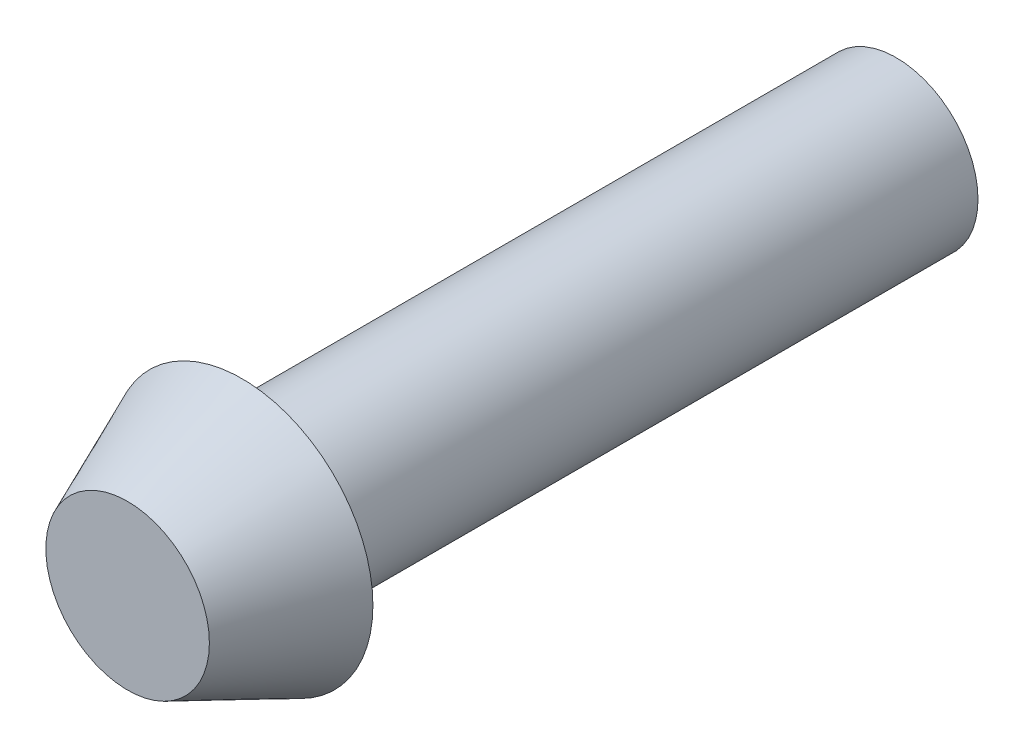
from build123d import *


with BuildPart() as part:
    # BaseBodySke → BaseBody (revolve)
    with BuildSketch(Plane(origin=(0, 0, 0), x_dir=(1, 0, 0), z_dir=(0, 1, 0)), mode=Mode.PRIVATE) as basebody_sk:
        Polygon((-5.08, 4.445), (-3.175, 4.445), (-3.175, 29.845), (0, 29.845), (0, 0), (-3.175, 0), align=None)
    revolve(basebody_sk.sketch.rotate(Axis((0, 0, 0), (0, 0, -1)), 180), axis=Axis((0, 0, 0), (0, 0, -1)))


solid = part.part
